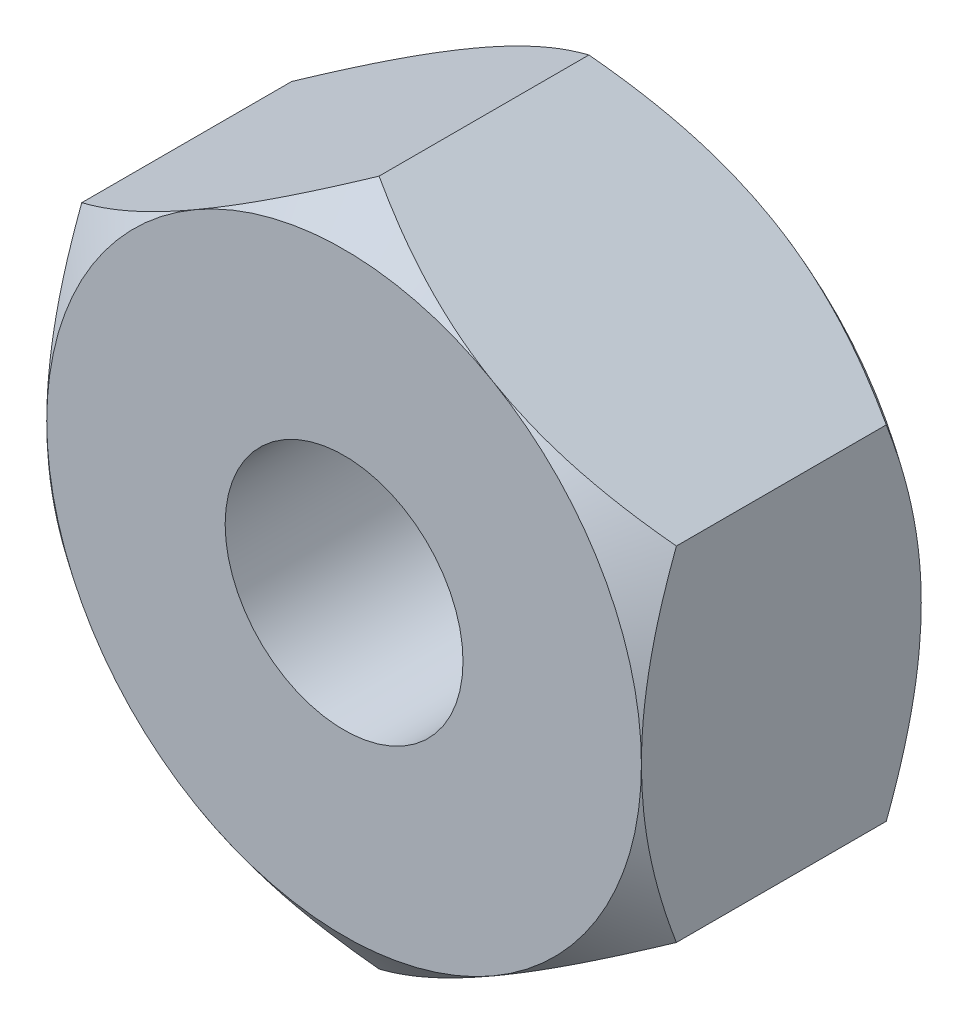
ISO-10303-21;
HEADER;
FILE_DESCRIPTION(('STEP AP214'),'2;1');
FILE_NAME('part.step','',(''),(''),'','','');
FILE_SCHEMA(('AUTOMOTIVE_DESIGN { 1 0 10303 214 1 1 1 1 }'));
ENDSEC;
DATA;
#1=APPLICATION_CONTEXT('core data for automotive mechanical design processes');
#2=APPLICATION_PROTOCOL_DEFINITION('international standard','automotive_design',2000,#1);
#3=PRODUCT_CONTEXT('',#1,'mechanical');
#4=PRODUCT('Part','Part','',(#3));
#5=PRODUCT_RELATED_PRODUCT_CATEGORY('part','',(#4));
#6=PRODUCT_DEFINITION_FORMATION('','',#4);
#7=PRODUCT_DEFINITION_CONTEXT('part definition',#1,'design');
#8=PRODUCT_DEFINITION('design','',#6,#7);
#9=PRODUCT_DEFINITION_SHAPE('','',#8);
#10=(LENGTH_UNIT() NAMED_UNIT(*) SI_UNIT(.MILLI.,.METRE.));
#11=(NAMED_UNIT(*) PLANE_ANGLE_UNIT() SI_UNIT($,.RADIAN.));
#12=(NAMED_UNIT(*) SI_UNIT($,.STERADIAN.) SOLID_ANGLE_UNIT());
#13=UNCERTAINTY_MEASURE_WITH_UNIT(LENGTH_MEASURE(1.E-05),#10,'distance_accuracy_value','');
#14=(GEOMETRIC_REPRESENTATION_CONTEXT(3) GLOBAL_UNCERTAINTY_ASSIGNED_CONTEXT((#13)) GLOBAL_UNIT_ASSIGNED_CONTEXT((#10,
#11,#12)) REPRESENTATION_CONTEXT('',''));
#15=CARTESIAN_POINT('',(0.,0.,0.));
#16=DIRECTION('',(0.,0.,1.));
#17=DIRECTION('',(1.,0.,0.));
#18=AXIS2_PLACEMENT_3D('',#15,#16,#17);
#19=CARTESIAN_POINT('',(0.,-9.81495457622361,8.00000000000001));
#20=DIRECTION('',(-0.499999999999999,0.866025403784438,0.));
#21=DIRECTION('',(-0.866025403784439,-0.5,0.));
#22=AXIS2_PLACEMENT_3D('',#19,#20,#21);
#23=PLANE('',#22);
#24=CARTESIAN_POINT('',(-0.000200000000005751,-9.81507004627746,6.99991218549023));
#25=CARTESIAN_POINT('',(0.154773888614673,-9.72559582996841,7.06794759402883));
#26=CARTESIAN_POINT('',(0.310535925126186,-9.63566657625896,7.13355791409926));
#27=CARTESIAN_POINT('',(0.623762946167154,-9.45482487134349,7.2592836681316));
#28=CARTESIAN_POINT('',(0.781228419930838,-9.36391213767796,7.31939747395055));
#29=CARTESIAN_POINT('',(1.25712979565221,-9.08915035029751,7.4907913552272));
#30=CARTESIAN_POINT('',(1.57819270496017,-8.90378459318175,7.59273041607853));
#31=CARTESIAN_POINT('',(2.06284162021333,-8.62397241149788,7.72204771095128));
#32=CARTESIAN_POINT('',(2.22413291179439,-8.53085084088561,7.76109211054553));
#33=CARTESIAN_POINT('',(2.54804997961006,-8.34383723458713,7.83090911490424));
#34=CARTESIAN_POINT('',(2.71067559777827,-8.24994529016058,7.8616826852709));
#35=CARTESIAN_POINT('',(3.03683362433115,-8.06163786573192,7.91431393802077));
#36=CARTESIAN_POINT('',(3.20036488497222,-7.96722304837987,7.93618106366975));
#37=CARTESIAN_POINT('',(3.52814590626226,-7.77797858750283,7.97056598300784));
#38=CARTESIAN_POINT('',(3.69239556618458,-7.6831490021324,7.98308504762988));
#39=CARTESIAN_POINT('',(4.02359631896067,-7.49193015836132,7.99859692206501));
#40=CARTESIAN_POINT('',(4.190552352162,-7.39553804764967,8.00145043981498));
#41=CARTESIAN_POINT('',(4.52436810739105,-7.20280943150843,7.99717209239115));
#42=CARTESIAN_POINT('',(4.69122782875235,-7.10647292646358,7.99004015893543));
#43=CARTESIAN_POINT('',(5.02449122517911,-6.91406321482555,7.96595737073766));
#44=CARTESIAN_POINT('',(5.19089465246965,-6.81799015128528,7.94900195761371));
#45=CARTESIAN_POINT('',(5.52278685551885,-6.62637209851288,7.90567140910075));
#46=CARTESIAN_POINT('',(5.68827550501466,-6.53082718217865,7.87929500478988));
#47=CARTESIAN_POINT('',(6.18273408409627,-6.24535138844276,7.78688387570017));
#48=CARTESIAN_POINT('',(6.50987787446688,-6.05647483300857,7.7075530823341));
#49=CARTESIAN_POINT('',(7.15744751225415,-5.68260032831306,7.5192603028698));
#50=CARTESIAN_POINT('',(7.47787498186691,-5.49760144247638,7.41030556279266));
#51=CARTESIAN_POINT('',(7.91346962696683,-5.24611075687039,7.24434338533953));
#52=CARTESIAN_POINT('',(8.03162001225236,-5.17789660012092,7.19748863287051));
#53=CARTESIAN_POINT('',(8.26672803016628,-5.0421569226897,7.10084793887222));
#54=CARTESIAN_POINT('',(8.3836877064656,-4.97463022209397,7.05106863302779));
#55=CARTESIAN_POINT('',(8.5002,-4.90736181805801,6.99991218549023));
#56=B_SPLINE_CURVE_WITH_KNOTS('',3,(#24,#25,#26,#27,#28,#29,#30,#31,#32,#33,#34,#35,#36,#37,#38,
#39,#40,#41,#42,#43,#44,#45,#46,#47,#48,#49,#50,#51,#52,#53,#54,#55),.UNSPECIFIED.,.F.,.F.,(4,2,
2,2,2,2,2,2,2,2,2,2,2,2,2,4),(0.,0.57428550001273,1.14874056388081,2.30090758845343,
2.87163475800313,3.44229526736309,4.01234913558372,4.58232548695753,5.16048171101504,
5.73864188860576,6.31707056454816,6.89557717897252,8.05196379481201,9.20806781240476,
9.64079373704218,10.0725731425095),.UNSPECIFIED.);
#57=CARTESIAN_POINT('',(0.,-9.81495457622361,6.9999999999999));
#58=VERTEX_POINT('',#57);
#59=CARTESIAN_POINT('',(4.24999999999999,-7.36121593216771,8.00000000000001));
#60=VERTEX_POINT('',#59);
#61=EDGE_CURVE('E558',#58,#60,#56,.T.);
#62=ORIENTED_EDGE('',*,*,#61,.F.);
#63=DIRECTION('',(0.,0.,-1.));
#64=VECTOR('',#63,1.);
#65=CARTESIAN_POINT('',(0.,-9.81495457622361,8.00000000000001));
#66=LINE('',#65,#64);
#67=CARTESIAN_POINT('',(0.,-9.81495457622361,1.00000000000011));
#68=VERTEX_POINT('',#67);
#69=EDGE_CURVE('E468',#58,#68,#66,.T.);
#70=ORIENTED_EDGE('',*,*,#69,.T.);
#71=CARTESIAN_POINT('',(8.5002,-4.90736181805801,1.00008781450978));
#72=CARTESIAN_POINT('',(8.34522611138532,-4.99683603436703,0.932052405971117));
#73=CARTESIAN_POINT('',(8.1894640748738,-5.08676528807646,0.866442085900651));
#74=CARTESIAN_POINT('',(7.87623705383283,-5.26760699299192,0.740716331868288));
#75=CARTESIAN_POINT('',(7.71877158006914,-5.35851972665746,0.680602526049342));
#76=CARTESIAN_POINT('',(7.24287020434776,-5.63328151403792,0.509208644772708));
#77=CARTESIAN_POINT('',(6.92180729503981,-5.81864727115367,0.407269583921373));
#78=CARTESIAN_POINT('',(6.43715837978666,-6.09845945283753,0.277952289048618));
#79=CARTESIAN_POINT('',(6.2758670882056,-6.1915810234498,0.238907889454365));
#80=CARTESIAN_POINT('',(5.95195002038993,-6.37859462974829,0.169090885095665));
#81=CARTESIAN_POINT('',(5.78932440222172,-6.47248657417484,0.138317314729));
#82=CARTESIAN_POINT('',(5.46316637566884,-6.6607939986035,0.0856860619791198));
#83=CARTESIAN_POINT('',(5.29963511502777,-6.75520881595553,0.0638189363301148));
#84=CARTESIAN_POINT('',(4.97185409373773,-6.9444532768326,0.0294340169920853));
#85=CARTESIAN_POINT('',(4.80760443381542,-7.03928286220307,0.0169149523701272));
#86=CARTESIAN_POINT('',(4.47640368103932,-7.23050170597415,0.00140307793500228));
#87=CARTESIAN_POINT('',(4.30944764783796,-7.32689381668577,-0.00145043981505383));
#88=CARTESIAN_POINT('',(3.97563189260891,-7.519622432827,0.00282790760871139));
#89=CARTESIAN_POINT('',(3.8087721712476,-7.61595893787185,0.00995984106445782));
#90=CARTESIAN_POINT('',(3.47550877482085,-7.80836864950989,0.0340426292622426));
#91=CARTESIAN_POINT('',(3.30910534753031,-7.90444171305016,0.0509980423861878));
#92=CARTESIAN_POINT('',(2.97721314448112,-8.09605976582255,0.094328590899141));
#93=CARTESIAN_POINT('',(2.81172449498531,-8.19160468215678,0.120704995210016));
#94=CARTESIAN_POINT('',(2.3172659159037,-8.47708047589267,0.213116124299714));
#95=CARTESIAN_POINT('',(1.99012212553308,-8.66595703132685,0.29244691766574));
#96=CARTESIAN_POINT('',(1.34255248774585,-9.03983153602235,0.480739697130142));
#97=CARTESIAN_POINT('',(1.02212501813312,-9.22483042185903,0.58969443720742));
#98=CARTESIAN_POINT('',(0.586530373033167,-9.47632110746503,0.755656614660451));
#99=CARTESIAN_POINT('',(0.468379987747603,-9.5445352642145,0.802511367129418));
#100=CARTESIAN_POINT('',(0.233271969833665,-9.68027494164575,0.89915206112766));
#101=CARTESIAN_POINT('',(0.116312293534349,-9.74780164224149,0.948931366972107));
#102=CARTESIAN_POINT('',(-0.000200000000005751,-9.81507004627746,1.00008781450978));
#103=B_SPLINE_CURVE_WITH_KNOTS('',3,(#71,#72,#73,#74,#75,#76,#77,#78,#79,#80,#81,#82,#83,#84,
#85,#86,#87,#88,#89,#90,#91,#92,#93,#94,#95,#96,#97,#98,#99,#100,#101,#102),.UNSPECIFIED.,.F.,
.F.,(4,2,2,2,2,2,2,2,2,2,2,2,2,2,2,4),(0.,0.574285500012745,1.14874056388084,2.30090758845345,
2.87163475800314,3.4422952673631,4.01234913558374,4.58232548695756,5.16048171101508,
5.7386418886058,6.3170705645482,6.89557717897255,8.05196379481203,9.20806781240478,
9.64079373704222,10.0725731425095),.UNSPECIFIED.);
#104=CARTESIAN_POINT('',(4.24999999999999,-7.36121593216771,0.));
#105=VERTEX_POINT('',#104);
#106=EDGE_CURVE('E512',#105,#68,#103,.T.);
#107=ORIENTED_EDGE('',*,*,#106,.F.);
#108=CARTESIAN_POINT('',(8.49999999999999,-4.90747728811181,0.99999999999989));
#109=VERTEX_POINT('',#108);
#110=EDGE_CURVE('E592',#109,#105,#103,.T.);
#111=ORIENTED_EDGE('',*,*,#110,.F.);
#112=DIRECTION('',(0.,0.,-1.));
#113=VECTOR('',#112,1.);
#114=CARTESIAN_POINT('',(8.49999999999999,-4.90747728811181,8.00000000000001));
#115=LINE('',#114,#113);
#116=CARTESIAN_POINT('',(8.49999999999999,-4.90747728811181,6.9999999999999));
#117=VERTEX_POINT('',#116);
#118=EDGE_CURVE('E473',#117,#109,#115,.T.);
#119=ORIENTED_EDGE('',*,*,#118,.F.);
#120=EDGE_CURVE('E554',#60,#117,#56,.T.);
#121=ORIENTED_EDGE('',*,*,#120,.F.);
#122=EDGE_LOOP('',(#62,#70,#107,#111,#119,#121));
#123=FACE_BOUND('',#122,.T.);
#124=ADVANCED_FACE('F348',(#123),#23,.F.);
#125=CARTESIAN_POINT('',(8.49999999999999,-4.90747728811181,8.00000000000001));
#126=DIRECTION('',(-1.,0.,0.));
#127=DIRECTION('',(0.,0.,1.));
#128=AXIS2_PLACEMENT_3D('',#125,#126,#127);
#129=PLANE('',#128);
#130=CARTESIAN_POINT('',(8.49999999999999,-11.4988448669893,3.58964177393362));
#131=CARTESIAN_POINT('',(8.49999999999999,-11.1961340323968,3.77471543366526));
#132=CARTESIAN_POINT('',(8.5,-10.8922997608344,3.95798224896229));
#133=CARTESIAN_POINT('',(8.5,-10.2818698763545,4.31999758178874));
#134=CARTESIAN_POINT('',(8.5,-9.97527370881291,4.49874516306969));
#135=CARTESIAN_POINT('',(8.5,-9.35688206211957,4.85190993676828));
#136=CARTESIAN_POINT('',(8.49999999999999,-9.04506557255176,5.02629046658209));
#137=CARTESIAN_POINT('',(8.49999999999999,-8.41768892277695,5.36815910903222));
#138=CARTESIAN_POINT('',(8.49999999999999,-8.10212898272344,5.53564762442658));
#139=CARTESIAN_POINT('',(8.49999999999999,-7.45193398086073,5.86959951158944));
#140=CARTESIAN_POINT('',(8.49999999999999,-7.11709046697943,6.03565921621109));
#141=CARTESIAN_POINT('',(8.49999999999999,-6.44169262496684,6.35592851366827));
#142=CARTESIAN_POINT('',(8.49999999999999,-6.10113754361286,6.51013652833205));
#143=CARTESIAN_POINT('',(8.49999999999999,-5.41435596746,6.80303232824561));
#144=CARTESIAN_POINT('',(8.49999999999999,-5.06814571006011,6.94175781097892));
#145=CARTESIAN_POINT('',(8.49999999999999,-4.36868728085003,7.19992243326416));
#146=CARTESIAN_POINT('',(8.49999999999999,-4.01544180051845,7.31936879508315));
#147=CARTESIAN_POINT('',(8.49999999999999,-3.29260616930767,7.53667035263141));
#148=CARTESIAN_POINT('',(8.49999999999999,-2.92282795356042,7.63391609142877));
#149=CARTESIAN_POINT('',(8.49999999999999,-2.36304219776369,7.75623288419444));
#150=CARTESIAN_POINT('',(8.49999999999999,-2.1755760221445,7.79308220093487));
#151=CARTESIAN_POINT('',(8.49999999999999,-1.79917612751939,7.85824891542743));
#152=CARTESIAN_POINT('',(8.49999999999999,-1.61024261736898,7.88656750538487));
#153=CARTESIAN_POINT('',(8.49999999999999,-1.23443703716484,7.93368293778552));
#154=CARTESIAN_POINT('',(8.49999999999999,-1.04758423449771,7.95263289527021));
#155=CARTESIAN_POINT('',(8.49999999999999,-0.673167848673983,7.98130707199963));
#156=CARTESIAN_POINT('',(8.49999999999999,-0.485604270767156,7.9910313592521));
#157=CARTESIAN_POINT('',(8.49999999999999,-0.110226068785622,8.00103043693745));
#158=CARTESIAN_POINT('',(8.49999999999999,0.0775885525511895,8.00130532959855));
#159=CARTESIAN_POINT('',(8.49999999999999,0.452990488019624,7.99239953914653));
#160=CARTESIAN_POINT('',(8.49999999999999,0.640577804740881,7.98321896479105));
#161=CARTESIAN_POINT('',(8.49999999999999,1.00024316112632,7.95670657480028));
#162=CARTESIAN_POINT('',(8.49999999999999,1.17237354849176,7.94007746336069));
#163=CARTESIAN_POINT('',(8.49999999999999,1.51574729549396,7.89929562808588));
#164=CARTESIAN_POINT('',(8.49999999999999,1.68699056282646,7.8751421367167));
#165=CARTESIAN_POINT('',(8.49999999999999,2.19894259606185,7.79200612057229));
#166=CARTESIAN_POINT('',(8.49999999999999,2.53795099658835,7.72234202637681));
#167=CARTESIAN_POINT('',(8.49999999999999,3.21645991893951,7.55709142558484));
#168=CARTESIAN_POINT('',(8.49999999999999,3.55584128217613,7.46102620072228));
#169=CARTESIAN_POINT('',(8.49999999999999,4.05988961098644,7.30144686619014));
#170=CARTESIAN_POINT('',(8.49999999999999,4.22706552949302,7.24567462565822));
#171=CARTESIAN_POINT('',(8.49999999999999,4.559792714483,7.12948993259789));
#172=CARTESIAN_POINT('',(8.49999999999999,4.7253440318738,7.0690776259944));
#173=CARTESIAN_POINT('',(8.49999999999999,5.20920160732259,6.8855888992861));
#174=CARTESIAN_POINT('',(8.49999999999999,5.52535249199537,6.75681638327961));
#175=CARTESIAN_POINT('',(8.49999999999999,6.15233262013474,6.48684544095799));
#176=CARTESIAN_POINT('',(8.49999999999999,6.46316058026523,6.34564406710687));
#177=CARTESIAN_POINT('',(8.49999999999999,7.08036655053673,6.05317540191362));
#178=CARTESIAN_POINT('',(8.49999999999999,7.38674028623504,5.90189913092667));
#179=CARTESIAN_POINT('',(8.49999999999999,7.99536190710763,5.59135540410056));
#180=CARTESIAN_POINT('',(8.49999999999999,8.29761010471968,5.432088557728));
#181=CARTESIAN_POINT('',(8.49999999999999,8.89996391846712,5.10632351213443));
#182=CARTESIAN_POINT('',(8.49999999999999,9.20005337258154,4.93979552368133));
#183=CARTESIAN_POINT('',(8.49999999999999,9.79719793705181,4.60138882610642));
#184=CARTESIAN_POINT('',(8.49999999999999,10.0942530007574,4.42951003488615));
#185=CARTESIAN_POINT('',(8.49999999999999,10.6856190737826,4.08142812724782));
#186=CARTESIAN_POINT('',(8.49999999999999,10.9799313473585,3.90522715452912));
#187=CARTESIAN_POINT('',(8.49999999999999,11.5663288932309,3.54915399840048));
#188=CARTESIAN_POINT('',(8.49999999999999,11.858414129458,3.369281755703));
#189=CARTESIAN_POINT('',(8.49999999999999,12.6735948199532,2.86133456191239));
#190=CARTESIAN_POINT('',(8.49999999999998,13.1945494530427,2.52982421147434));
#191=CARTESIAN_POINT('',(8.49999999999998,14.2317398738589,1.85939319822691));
#192=CARTESIAN_POINT('',(8.49999999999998,14.7479750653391,1.52047161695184));
#193=CARTESIAN_POINT('',(8.49999999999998,15.7716273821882,0.840362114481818));
#194=CARTESIAN_POINT('',(8.49999999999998,16.2790812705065,0.499229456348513));
#195=CARTESIAN_POINT('',(8.49999999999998,17.0380119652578,-0.015670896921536));
#196=CARTESIAN_POINT('',(8.49999999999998,17.2905892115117,-0.187820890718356));
#197=CARTESIAN_POINT('',(8.49999999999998,17.7950814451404,-0.533085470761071));
#198=CARTESIAN_POINT('',(8.49999999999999,18.0469964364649,-0.706200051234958));
#199=CARTESIAN_POINT('',(8.49999999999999,18.2986173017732,-0.879741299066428));
#200=B_SPLINE_CURVE_WITH_KNOTS('',3,(#130,#131,#132,#133,#134,#135,#136,#137,#138,#139,#140,
#141,#142,#143,#144,#145,#146,#147,#148,#149,#150,#151,#152,#153,#154,#155,#156,#157,#158,#159,
#160,#161,#162,#163,#164,#165,#166,#167,#168,#169,#170,#171,#172,#173,#174,#175,#176,#177,#178,
#179,#180,#181,#182,#183,#184,#185,#186,#187,#188,#189,#190,#191,#192,#193,#194,#195,#196,#197,
#198,#199),.UNSPECIFIED.,.F.,.F.,(4,2,2,2,2,2,2,2,2,2,2,2,2,2,2,2,2,2,2,2,2,2,2,2,2,2,2,2,2,2,2,
2,2,2,4),(0.,1.06443043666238,2.12907961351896,3.2008024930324,4.27246265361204,5.393556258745,
6.51479889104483,7.6332490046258,8.75127915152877,9.89705804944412,10.4700551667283,
11.0429721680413,11.6061877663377,12.1693992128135,12.7326045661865,13.2958034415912,
13.8144239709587,14.3330974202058,15.3702121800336,16.4275382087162,16.9561825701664,
17.4848103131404,18.5085534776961,19.5325400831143,20.5574518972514,21.5822856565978,
22.6118150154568,23.6413601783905,24.670404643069,25.6994657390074,27.5518386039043,
29.4044423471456,31.2387862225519,32.1557785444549,33.0727653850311),.UNSPECIFIED.);
#201=CARTESIAN_POINT('',(8.49999999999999,0.,8.00000000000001));
#202=VERTEX_POINT('',#201);
#203=EDGE_CURVE('E548',#117,#202,#200,.T.);
#204=ORIENTED_EDGE('',*,*,#203,.F.);
#205=ORIENTED_EDGE('',*,*,#118,.T.);
#206=CARTESIAN_POINT('',(8.49999999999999,-11.4988448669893,4.41035822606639));
#207=CARTESIAN_POINT('',(8.49999999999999,-11.1961340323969,4.2252845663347));
#208=CARTESIAN_POINT('',(8.5,-10.8922997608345,4.04201775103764));
#209=CARTESIAN_POINT('',(8.5,-10.2818698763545,3.68000241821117));
#210=CARTESIAN_POINT('',(8.5,-9.97527370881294,3.50125483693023));
#211=CARTESIAN_POINT('',(8.5,-9.3568820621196,3.14809006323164));
#212=CARTESIAN_POINT('',(8.49999999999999,-9.04506557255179,2.97370953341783));
#213=CARTESIAN_POINT('',(8.49999999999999,-8.41768892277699,2.6318408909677));
#214=CARTESIAN_POINT('',(8.49999999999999,-8.10212898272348,2.46435237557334));
#215=CARTESIAN_POINT('',(8.49999999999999,-7.45193398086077,2.13040048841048));
#216=CARTESIAN_POINT('',(8.49999999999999,-7.11709046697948,1.96434078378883));
#217=CARTESIAN_POINT('',(8.49999999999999,-6.44169262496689,1.64407148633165));
#218=CARTESIAN_POINT('',(8.49999999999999,-6.10113754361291,1.48986347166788));
#219=CARTESIAN_POINT('',(8.49999999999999,-5.41435596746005,1.1969676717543));
#220=CARTESIAN_POINT('',(8.49999999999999,-5.06814571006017,1.05824218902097));
#221=CARTESIAN_POINT('',(8.49999999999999,-4.36868728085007,0.80007756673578));
#222=CARTESIAN_POINT('',(8.49999999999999,-4.01544180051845,0.680631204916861));
#223=CARTESIAN_POINT('',(8.49999999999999,-3.29260616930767,0.463329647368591));
#224=CARTESIAN_POINT('',(8.49999999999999,-2.92282795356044,0.366083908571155));
#225=CARTESIAN_POINT('',(8.49999999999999,-2.36304219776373,0.243767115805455));
#226=CARTESIAN_POINT('',(8.49999999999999,-2.17557602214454,0.206917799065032));
#227=CARTESIAN_POINT('',(8.49999999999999,-1.79917612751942,0.141751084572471));
#228=CARTESIAN_POINT('',(8.49999999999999,-1.61024261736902,0.113432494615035));
#229=CARTESIAN_POINT('',(8.49999999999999,-1.23443703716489,0.0663170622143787));
#230=CARTESIAN_POINT('',(8.49999999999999,-1.04758423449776,0.0473671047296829));
#231=CARTESIAN_POINT('',(8.49999999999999,-0.673167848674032,0.0186929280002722));
#232=CARTESIAN_POINT('',(8.49999999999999,-0.485604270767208,0.00896864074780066));
#233=CARTESIAN_POINT('',(8.49999999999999,-0.110226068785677,-0.00103043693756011));
#234=CARTESIAN_POINT('',(8.49999999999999,0.0775885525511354,-0.00130532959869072));
#235=CARTESIAN_POINT('',(8.49999999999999,0.452990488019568,0.00760046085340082));
#236=CARTESIAN_POINT('',(8.49999999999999,0.640577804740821,0.0167810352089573));
#237=CARTESIAN_POINT('',(8.49999999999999,1.00024316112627,0.0432934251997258));
#238=CARTESIAN_POINT('',(8.49999999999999,1.17237354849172,0.0599225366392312));
#239=CARTESIAN_POINT('',(8.49999999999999,1.51574729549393,0.100704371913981));
#240=CARTESIAN_POINT('',(8.49999999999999,1.68699056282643,0.124857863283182));
#241=CARTESIAN_POINT('',(8.49999999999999,2.19894259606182,0.207993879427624));
#242=CARTESIAN_POINT('',(8.49999999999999,2.53795099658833,0.277657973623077));
#243=CARTESIAN_POINT('',(8.49999999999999,3.21645991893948,0.442908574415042));
#244=CARTESIAN_POINT('',(8.49999999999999,3.5558412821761,0.538973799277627));
#245=CARTESIAN_POINT('',(8.49999999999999,4.05988961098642,0.698553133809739));
#246=CARTESIAN_POINT('',(8.49999999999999,4.227065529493,0.75432537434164));
#247=CARTESIAN_POINT('',(8.49999999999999,4.55979271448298,0.870510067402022));
#248=CARTESIAN_POINT('',(8.49999999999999,4.72534403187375,0.930922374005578));
#249=CARTESIAN_POINT('',(8.49999999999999,5.20920160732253,1.11441110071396));
#250=CARTESIAN_POINT('',(8.49999999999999,5.52535249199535,1.24318361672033));
#251=CARTESIAN_POINT('',(8.49999999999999,6.15233262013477,1.51315455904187));
#252=CARTESIAN_POINT('',(8.49999999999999,6.46316058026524,1.65435593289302));
#253=CARTESIAN_POINT('',(8.49999999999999,7.08036655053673,1.9468245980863));
#254=CARTESIAN_POINT('',(8.49999999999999,7.38674028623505,2.09810086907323));
#255=CARTESIAN_POINT('',(8.49999999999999,7.99536190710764,2.40864459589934));
#256=CARTESIAN_POINT('',(8.49999999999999,8.29761010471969,2.5679114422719));
#257=CARTESIAN_POINT('',(8.49999999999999,8.89996391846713,2.89367648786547));
#258=CARTESIAN_POINT('',(8.49999999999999,9.20005337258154,3.06020447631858));
#259=CARTESIAN_POINT('',(8.49999999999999,9.79719793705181,3.39861117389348));
#260=CARTESIAN_POINT('',(8.49999999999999,10.0942530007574,3.57048996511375));
#261=CARTESIAN_POINT('',(8.49999999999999,10.6856190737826,3.91857187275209));
#262=CARTESIAN_POINT('',(8.49999999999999,10.9799313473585,4.09477284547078));
#263=CARTESIAN_POINT('',(8.49999999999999,11.5663288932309,4.45084600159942));
#264=CARTESIAN_POINT('',(8.49999999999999,11.858414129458,4.6307182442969));
#265=CARTESIAN_POINT('',(8.49999999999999,12.6735948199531,5.13866543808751));
#266=CARTESIAN_POINT('',(8.49999999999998,13.1945494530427,5.47017578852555));
#267=CARTESIAN_POINT('',(8.49999999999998,14.2317398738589,6.14060680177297));
#268=CARTESIAN_POINT('',(8.49999999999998,14.7479750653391,6.47952838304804));
#269=CARTESIAN_POINT('',(8.49999999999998,15.7716273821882,7.15963788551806));
#270=CARTESIAN_POINT('',(8.49999999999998,16.2790812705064,7.50077054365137));
#271=CARTESIAN_POINT('',(8.49999999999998,17.0380119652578,8.01567089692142));
#272=CARTESIAN_POINT('',(8.49999999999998,17.2905892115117,8.18782089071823));
#273=CARTESIAN_POINT('',(8.49999999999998,17.7950814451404,8.53308547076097));
#274=CARTESIAN_POINT('',(8.49999999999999,18.0469964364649,8.70620005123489));
#275=CARTESIAN_POINT('',(8.49999999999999,18.2986173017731,8.87974129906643));
#276=B_SPLINE_CURVE_WITH_KNOTS('',3,(#206,#207,#208,#209,#210,#211,#212,#213,#214,#215,#216,
#217,#218,#219,#220,#221,#222,#223,#224,#225,#226,#227,#228,#229,#230,#231,#232,#233,#234,#235,
#236,#237,#238,#239,#240,#241,#242,#243,#244,#245,#246,#247,#248,#249,#250,#251,#252,#253,#254,
#255,#256,#257,#258,#259,#260,#261,#262,#263,#264,#265,#266,#267,#268,#269,#270,#271,#272,#273,
#274,#275),.UNSPECIFIED.,.F.,.F.,(4,2,2,2,2,2,2,2,2,2,2,2,2,2,2,2,2,2,2,2,2,2,2,2,2,2,2,2,2,2,2,
2,2,2,4),(0.,1.0644304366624,2.12907961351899,3.20080249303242,4.27246265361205,
5.39355625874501,6.51479889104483,7.6332490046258,8.75127915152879,9.89705804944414,
10.4700551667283,11.0429721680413,11.6061877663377,12.1693992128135,12.7326045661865,
13.2958034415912,13.8144239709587,14.3330974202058,15.3702121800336,16.4275382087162,
16.9561825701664,17.4848103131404,18.5085534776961,19.5325400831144,20.5574518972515,
21.5822856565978,22.6118150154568,23.6413601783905,24.670404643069,25.6994657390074,
27.5518386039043,29.4044423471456,31.2387862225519,32.155778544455,33.0727653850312),.UNSPECIFIED.);
#277=CARTESIAN_POINT('',(8.49999999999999,0.,0.));
#278=VERTEX_POINT('',#277);
#279=EDGE_CURVE('E522',#278,#109,#276,.F.);
#280=ORIENTED_EDGE('',*,*,#279,.F.);
#281=CARTESIAN_POINT('',(8.49999999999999,4.90747728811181,0.99999999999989));
#282=VERTEX_POINT('',#281);
#283=EDGE_CURVE('E527',#282,#278,#276,.F.);
#284=ORIENTED_EDGE('',*,*,#283,.F.);
#285=DIRECTION('',(0.,0.,-1.));
#286=VECTOR('',#285,1.);
#287=CARTESIAN_POINT('',(8.49999999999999,4.90747728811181,8.00000000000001));
#288=LINE('',#287,#286);
#289=CARTESIAN_POINT('',(8.49999999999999,4.90747728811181,6.9999999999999));
#290=VERTEX_POINT('',#289);
#291=EDGE_CURVE('E466',#290,#282,#288,.T.);
#292=ORIENTED_EDGE('',*,*,#291,.F.);
#293=EDGE_CURVE('E542',#202,#290,#200,.T.);
#294=ORIENTED_EDGE('',*,*,#293,.F.);
#295=EDGE_LOOP('',(#204,#205,#280,#284,#292,#294));
#296=FACE_BOUND('',#295,.T.);
#297=ADVANCED_FACE('F534',(#296),#129,.F.);
#298=CARTESIAN_POINT('',(8.49999999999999,4.90747728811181,8.00000000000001));
#299=DIRECTION('',(-0.500000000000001,-0.866025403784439,0.));
#300=DIRECTION('',(0.866025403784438,-0.5,0.));
#301=AXIS2_PLACEMENT_3D('',#298,#299,#300);
#302=PLANE('',#301);
#303=CARTESIAN_POINT('',(8.5002,4.90736181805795,6.99991218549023));
#304=CARTESIAN_POINT('',(8.34522611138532,4.99683603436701,7.06794759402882));
#305=CARTESIAN_POINT('',(8.1894640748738,5.08676528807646,7.13355791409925));
#306=CARTESIAN_POINT('',(7.87623705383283,5.26760699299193,7.25928366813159));
#307=CARTESIAN_POINT('',(7.71877158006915,5.35851972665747,7.31939747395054));
#308=CARTESIAN_POINT('',(7.24287020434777,5.63328151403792,7.49079135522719));
#309=CARTESIAN_POINT('',(6.92180729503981,5.81864727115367,7.59273041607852));
#310=CARTESIAN_POINT('',(6.43715837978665,6.09845945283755,7.72204771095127));
#311=CARTESIAN_POINT('',(6.27586708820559,6.19158102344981,7.76109211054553));
#312=CARTESIAN_POINT('',(5.95195002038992,6.37859462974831,7.83090911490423));
#313=CARTESIAN_POINT('',(5.78932440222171,6.47248657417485,7.8616826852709));
#314=CARTESIAN_POINT('',(5.46316637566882,6.66079399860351,7.91431393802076));
#315=CARTESIAN_POINT('',(5.29963511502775,6.75520881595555,7.93618106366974));
#316=CARTESIAN_POINT('',(4.97185409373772,6.94445327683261,7.97056598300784));
#317=CARTESIAN_POINT('',(4.80760443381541,7.03928286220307,7.98308504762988));
#318=CARTESIAN_POINT('',(4.47640368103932,7.23050170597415,7.998596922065));
#319=CARTESIAN_POINT('',(4.30944764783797,7.32689381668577,8.00145043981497));
#320=CARTESIAN_POINT('',(3.97563189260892,7.519622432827,7.99717209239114));
#321=CARTESIAN_POINT('',(3.80877217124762,7.61595893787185,7.99004015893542));
#322=CARTESIAN_POINT('',(3.47550877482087,7.80836864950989,7.96595737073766));
#323=CARTESIAN_POINT('',(3.30910534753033,7.90444171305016,7.9490019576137));
#324=CARTESIAN_POINT('',(2.97721314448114,8.09605976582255,7.90567140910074));
#325=CARTESIAN_POINT('',(2.81172449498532,8.19160468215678,7.87929500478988));
#326=CARTESIAN_POINT('',(2.31726591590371,8.47708047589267,7.78688387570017));
#327=CARTESIAN_POINT('',(1.99012212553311,8.66595703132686,7.7075530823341));
#328=CARTESIAN_POINT('',(1.34255248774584,9.03983153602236,7.5192603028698));
#329=CARTESIAN_POINT('',(1.02212501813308,9.22483042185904,7.41030556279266));
#330=CARTESIAN_POINT('',(0.586530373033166,9.47632110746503,7.24434338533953));
#331=CARTESIAN_POINT('',(0.468379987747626,9.5445352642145,7.1974886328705));
#332=CARTESIAN_POINT('',(0.23327196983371,9.68027494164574,7.10084793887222));
#333=CARTESIAN_POINT('',(0.116312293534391,9.74780164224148,7.05106863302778));
#334=CARTESIAN_POINT('',(-0.000200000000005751,9.81507004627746,6.99991218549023));
#335=B_SPLINE_CURVE_WITH_KNOTS('',3,(#303,#304,#305,#306,#307,#308,#309,#310,#311,#312,#313,
#314,#315,#316,#317,#318,#319,#320,#321,#322,#323,#324,#325,#326,#327,#328,#329,#330,#331,#332,
#333,#334),.UNSPECIFIED.,.F.,.F.,(4,2,2,2,2,2,2,2,2,2,2,2,2,2,2,4),(0.,0.574285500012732,
1.14874056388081,2.30090758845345,2.87163475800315,3.44229526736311,4.01234913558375,
4.58232548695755,5.16048171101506,5.73864188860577,6.31707056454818,6.89557717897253,
8.05196379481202,9.20806781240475,9.64079373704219,10.0725731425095),.UNSPECIFIED.);
#336=CARTESIAN_POINT('',(4.25,7.36121593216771,8.00000000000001));
#337=VERTEX_POINT('',#336);
#338=EDGE_CURVE('E549',#290,#337,#335,.T.);
#339=ORIENTED_EDGE('',*,*,#338,.F.);
#340=ORIENTED_EDGE('',*,*,#291,.T.);
#341=CARTESIAN_POINT('',(-0.000199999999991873,9.81507004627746,1.00008781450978));
#342=CARTESIAN_POINT('',(0.154773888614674,9.72559582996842,0.93205240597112));
#343=CARTESIAN_POINT('',(0.310535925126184,9.63566657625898,0.866442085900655));
#344=CARTESIAN_POINT('',(0.623762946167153,9.45482487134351,0.740716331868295));
#345=CARTESIAN_POINT('',(0.781228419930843,9.36391213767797,0.680602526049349));
#346=CARTESIAN_POINT('',(1.25712979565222,9.08915035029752,0.509208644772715));
#347=CARTESIAN_POINT('',(1.57819270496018,8.90378459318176,0.40726958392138));
#348=CARTESIAN_POINT('',(2.06284162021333,8.6239724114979,0.277952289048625));
#349=CARTESIAN_POINT('',(2.22413291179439,8.53085084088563,0.238907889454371));
#350=CARTESIAN_POINT('',(2.54804997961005,8.34383723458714,0.169090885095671));
#351=CARTESIAN_POINT('',(2.71067559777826,8.2499452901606,0.138317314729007));
#352=CARTESIAN_POINT('',(3.03683362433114,8.06163786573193,0.0856860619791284));
#353=CARTESIAN_POINT('',(3.20036488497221,7.96722304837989,0.0638189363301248));
#354=CARTESIAN_POINT('',(3.52814590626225,7.77797858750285,0.029434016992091));
#355=CARTESIAN_POINT('',(3.69239556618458,7.68314900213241,0.0169149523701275));
#356=CARTESIAN_POINT('',(4.02359631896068,7.49193015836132,0.00140307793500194));
#357=CARTESIAN_POINT('',(4.19055235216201,7.39553804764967,-0.00145043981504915));
#358=CARTESIAN_POINT('',(4.52436810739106,7.20280943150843,0.00282790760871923));
#359=CARTESIAN_POINT('',(4.69122782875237,7.10647292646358,0.00995984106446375));
#360=CARTESIAN_POINT('',(5.02449122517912,6.91406321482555,0.0340426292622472));
#361=CARTESIAN_POINT('',(5.19089465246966,6.81799015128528,0.0509980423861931));
#362=CARTESIAN_POINT('',(5.52278685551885,6.62637209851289,0.0943285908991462));
#363=CARTESIAN_POINT('',(5.68827550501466,6.53082718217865,0.120704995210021));
#364=CARTESIAN_POINT('',(6.18273408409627,6.24535138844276,0.213116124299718));
#365=CARTESIAN_POINT('',(6.50987787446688,6.05647483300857,0.292446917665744));
#366=CARTESIAN_POINT('',(7.15744751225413,5.6826003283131,0.480739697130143));
#367=CARTESIAN_POINT('',(7.47787498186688,5.49760144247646,0.589694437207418));
#368=CARTESIAN_POINT('',(7.91346962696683,5.24611075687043,0.755656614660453));
#369=CARTESIAN_POINT('',(8.03162001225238,5.17789660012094,0.802511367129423));
#370=CARTESIAN_POINT('',(8.26672803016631,5.04215692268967,0.899152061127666));
#371=CARTESIAN_POINT('',(8.38368770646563,4.97463022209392,0.948931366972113));
#372=CARTESIAN_POINT('',(8.5002,4.90736181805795,1.00008781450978));
#373=B_SPLINE_CURVE_WITH_KNOTS('',3,(#341,#342,#343,#344,#345,#346,#347,#348,#349,#350,#351,
#352,#353,#354,#355,#356,#357,#358,#359,#360,#361,#362,#363,#364,#365,#366,#367,#368,#369,#370,
#371,#372),.UNSPECIFIED.,.F.,.F.,(4,2,2,2,2,2,2,2,2,2,2,2,2,2,2,4),(0.,0.574285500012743,
1.14874056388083,2.30090758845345,2.87163475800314,3.4422952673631,4.01234913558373,
4.58232548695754,5.16048171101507,5.73864188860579,6.31707056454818,6.89557717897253,
8.05196379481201,9.20806781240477,9.64079373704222,10.0725731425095),.UNSPECIFIED.);
#374=CARTESIAN_POINT('',(4.25,7.36121593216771,0.));
#375=VERTEX_POINT('',#374);
#376=EDGE_CURVE('E528',#375,#282,#373,.T.);
#377=ORIENTED_EDGE('',*,*,#376,.F.);
#378=CARTESIAN_POINT('',(0.,9.81495457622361,0.99999999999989));
#379=VERTEX_POINT('',#378);
#380=EDGE_CURVE('E609',#379,#375,#373,.T.);
#381=ORIENTED_EDGE('',*,*,#380,.F.);
#382=DIRECTION('',(0.,0.,-1.));
#383=VECTOR('',#382,1.);
#384=CARTESIAN_POINT('',(0.,9.81495457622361,8.00000000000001));
#385=LINE('',#384,#383);
#386=CARTESIAN_POINT('',(0.,9.81495457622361,6.9999999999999));
#387=VERTEX_POINT('',#386);
#388=EDGE_CURVE('E463',#387,#379,#385,.T.);
#389=ORIENTED_EDGE('',*,*,#388,.F.);
#390=EDGE_CURVE('E550',#337,#387,#335,.T.);
#391=ORIENTED_EDGE('',*,*,#390,.F.);
#392=EDGE_LOOP('',(#339,#340,#377,#381,#389,#391));
#393=FACE_BOUND('',#392,.T.);
#394=ADVANCED_FACE('F537',(#393),#302,.F.);
#395=CARTESIAN_POINT('',(0.,9.81495457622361,8.00000000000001));
#396=DIRECTION('',(0.499999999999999,-0.866025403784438,0.));
#397=DIRECTION('',(0.866025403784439,0.500000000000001,0.));
#398=AXIS2_PLACEMENT_3D('',#395,#396,#397);
#399=PLANE('',#398);
#400=CARTESIAN_POINT('',(0.000200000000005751,9.81507004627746,6.99991218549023));
#401=CARTESIAN_POINT('',(-0.154773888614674,9.72559582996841,7.06794759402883));
#402=CARTESIAN_POINT('',(-0.310535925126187,9.63566657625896,7.13355791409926));
#403=CARTESIAN_POINT('',(-0.623762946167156,9.45482487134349,7.2592836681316));
#404=CARTESIAN_POINT('',(-0.78122841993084,9.36391213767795,7.31939747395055));
#405=CARTESIAN_POINT('',(-1.25712979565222,9.08915035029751,7.4907913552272));
#406=CARTESIAN_POINT('',(-1.57819270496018,8.90378459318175,7.59273041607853));
#407=CARTESIAN_POINT('',(-2.06284162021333,8.62397241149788,7.72204771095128));
#408=CARTESIAN_POINT('',(-2.22413291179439,8.53085084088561,7.76109211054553));
#409=CARTESIAN_POINT('',(-2.54804997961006,8.34383723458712,7.83090911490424));
#410=CARTESIAN_POINT('',(-2.71067559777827,8.24994529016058,7.86168268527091));
#411=CARTESIAN_POINT('',(-3.03683362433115,8.06163786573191,7.91431393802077));
#412=CARTESIAN_POINT('',(-3.20036488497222,7.96722304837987,7.93618106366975));
#413=CARTESIAN_POINT('',(-3.52814590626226,7.77797858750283,7.97056598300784));
#414=CARTESIAN_POINT('',(-3.69239556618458,7.6831490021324,7.98308504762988));
#415=CARTESIAN_POINT('',(-4.02359631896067,7.49193015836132,7.998596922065));
#416=CARTESIAN_POINT('',(-4.190552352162,7.39553804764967,8.00145043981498));
#417=CARTESIAN_POINT('',(-4.52436810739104,7.20280943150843,7.99717209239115));
#418=CARTESIAN_POINT('',(-4.69122782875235,7.10647292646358,7.99004015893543));
#419=CARTESIAN_POINT('',(-5.0244912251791,6.91406321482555,7.96595737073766));
#420=CARTESIAN_POINT('',(-5.19089465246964,6.81799015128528,7.94900195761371));
#421=CARTESIAN_POINT('',(-5.52278685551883,6.62637209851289,7.90567140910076));
#422=CARTESIAN_POINT('',(-5.68827550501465,6.53082718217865,7.87929500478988));
#423=CARTESIAN_POINT('',(-6.18273408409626,6.24535138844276,7.78688387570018));
#424=CARTESIAN_POINT('',(-6.50987787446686,6.05647483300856,7.70755308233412));
#425=CARTESIAN_POINT('',(-7.15744751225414,5.68260032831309,7.5192603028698));
#426=CARTESIAN_POINT('',(-7.47787498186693,5.49760144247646,7.41030556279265));
#427=CARTESIAN_POINT('',(-7.91346962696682,5.24611075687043,7.24434338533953));
#428=CARTESIAN_POINT('',(-8.03162001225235,5.17789660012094,7.19748863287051));
#429=CARTESIAN_POINT('',(-8.26672803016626,5.04215692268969,7.10084793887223));
#430=CARTESIAN_POINT('',(-8.38368770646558,4.97463022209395,7.0510686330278));
#431=CARTESIAN_POINT('',(-8.5002,4.90736181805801,6.99991218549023));
#432=B_SPLINE_CURVE_WITH_KNOTS('',3,(#400,#401,#402,#403,#404,#405,#406,#407,#408,#409,#410,
#411,#412,#413,#414,#415,#416,#417,#418,#419,#420,#421,#422,#423,#424,#425,#426,#427,#428,#429,
#430,#431),.UNSPECIFIED.,.F.,.F.,(4,2,2,2,2,2,2,2,2,2,2,2,2,2,2,4),(0.,0.574285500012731,
1.14874056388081,2.30090758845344,2.87163475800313,3.44229526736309,4.01234913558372,
4.58232548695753,5.16048171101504,5.73864188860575,6.31707056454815,6.89557717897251,
8.05196379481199,9.20806781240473,9.64079373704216,10.0725731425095),.UNSPECIFIED.);
#433=CARTESIAN_POINT('',(-4.25,7.36121593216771,8.00000000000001));
#434=VERTEX_POINT('',#433);
#435=EDGE_CURVE('E447',#387,#434,#432,.T.);
#436=ORIENTED_EDGE('',*,*,#435,.F.);
#437=ORIENTED_EDGE('',*,*,#388,.T.);
#438=CARTESIAN_POINT('',(-8.5002,4.90736181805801,1.00008781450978));
#439=CARTESIAN_POINT('',(-8.34522611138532,4.99683603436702,0.932052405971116));
#440=CARTESIAN_POINT('',(-8.1894640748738,5.08676528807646,0.86644208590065));
#441=CARTESIAN_POINT('',(-7.87623705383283,5.26760699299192,0.740716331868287));
#442=CARTESIAN_POINT('',(-7.71877158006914,5.35851972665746,0.680602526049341));
#443=CARTESIAN_POINT('',(-7.24287020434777,5.63328151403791,0.509208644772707));
#444=CARTESIAN_POINT('',(-6.92180729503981,5.81864727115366,0.407269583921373));
#445=CARTESIAN_POINT('',(-6.43715837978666,6.09845945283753,0.277952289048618));
#446=CARTESIAN_POINT('',(-6.2758670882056,6.1915810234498,0.238907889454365));
#447=CARTESIAN_POINT('',(-5.95195002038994,6.37859462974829,0.169090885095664));
#448=CARTESIAN_POINT('',(-5.78932440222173,6.47248657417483,0.138317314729));
#449=CARTESIAN_POINT('',(-5.46316637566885,6.66079399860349,0.0856860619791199));
#450=CARTESIAN_POINT('',(-5.29963511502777,6.75520881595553,0.0638189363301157));
#451=CARTESIAN_POINT('',(-4.97185409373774,6.94445327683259,0.0294340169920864));
#452=CARTESIAN_POINT('',(-4.80760443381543,7.03928286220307,0.0169149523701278));
#453=CARTESIAN_POINT('',(-4.47640368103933,7.23050170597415,0.00140307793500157));
#454=CARTESIAN_POINT('',(-4.30944764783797,7.32689381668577,-0.00145043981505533));
#455=CARTESIAN_POINT('',(-3.97563189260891,7.51962243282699,0.00282790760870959));
#456=CARTESIAN_POINT('',(-3.80877217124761,7.61595893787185,0.0099598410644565));
#457=CARTESIAN_POINT('',(-3.47550877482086,7.80836864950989,0.0340426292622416));
#458=CARTESIAN_POINT('',(-3.30910534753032,7.90444171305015,0.0509980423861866));
#459=CARTESIAN_POINT('',(-2.97721314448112,8.09605976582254,0.0943285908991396));
#460=CARTESIAN_POINT('',(-2.81172449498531,8.19160468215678,0.120704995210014));
#461=CARTESIAN_POINT('',(-2.3172659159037,8.47708047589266,0.213116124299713));
#462=CARTESIAN_POINT('',(-1.99012212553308,8.66595703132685,0.292446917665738));
#463=CARTESIAN_POINT('',(-1.34255248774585,9.03983153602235,0.480739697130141));
#464=CARTESIAN_POINT('',(-1.02212501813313,9.22483042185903,0.589694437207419));
#465=CARTESIAN_POINT('',(-0.586530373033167,9.47632110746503,0.755656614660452));
#466=CARTESIAN_POINT('',(-0.468379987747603,9.5445352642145,0.802511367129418));
#467=CARTESIAN_POINT('',(-0.233271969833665,9.68027494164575,0.89915206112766));
#468=CARTESIAN_POINT('',(-0.116312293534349,9.74780164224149,0.948931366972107));
#469=CARTESIAN_POINT('',(0.000200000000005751,9.81507004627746,1.00008781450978));
#470=B_SPLINE_CURVE_WITH_KNOTS('',3,(#438,#439,#440,#441,#442,#443,#444,#445,#446,#447,#448,
#449,#450,#451,#452,#453,#454,#455,#456,#457,#458,#459,#460,#461,#462,#463,#464,#465,#466,#467,
#468,#469),.UNSPECIFIED.,.F.,.F.,(4,2,2,2,2,2,2,2,2,2,2,2,2,2,2,4),(0.,0.574285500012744,
1.14874056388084,2.30090758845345,2.87163475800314,3.4422952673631,4.01234913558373,
4.58232548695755,5.16048171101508,5.7386418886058,6.31707056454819,6.89557717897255,
8.05196379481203,9.20806781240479,9.64079373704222,10.0725731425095),.UNSPECIFIED.);
#471=CARTESIAN_POINT('',(-4.25,7.36121593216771,0.));
#472=VERTEX_POINT('',#471);
#473=EDGE_CURVE('E606',#472,#379,#470,.T.);
#474=ORIENTED_EDGE('',*,*,#473,.F.);
#475=CARTESIAN_POINT('',(-8.49999999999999,4.90747728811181,0.99999999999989));
#476=VERTEX_POINT('',#475);
#477=EDGE_CURVE('E462',#476,#472,#470,.T.);
#478=ORIENTED_EDGE('',*,*,#477,.F.);
#479=DIRECTION('',(0.,0.,-1.));
#480=VECTOR('',#479,1.);
#481=CARTESIAN_POINT('',(-8.49999999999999,4.90747728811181,8.00000000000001));
#482=LINE('',#481,#480);
#483=CARTESIAN_POINT('',(-8.49999999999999,4.90747728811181,6.9999999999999));
#484=VERTEX_POINT('',#483);
#485=EDGE_CURVE('E453',#484,#476,#482,.T.);
#486=ORIENTED_EDGE('',*,*,#485,.F.);
#487=EDGE_CURVE('E438',#434,#484,#432,.T.);
#488=ORIENTED_EDGE('',*,*,#487,.F.);
#489=EDGE_LOOP('',(#436,#437,#474,#478,#486,#488));
#490=FACE_BOUND('',#489,.T.);
#491=ADVANCED_FACE('F459',(#490),#399,.F.);
#492=CARTESIAN_POINT('',(-8.49999999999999,4.90747728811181,8.00000000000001));
#493=DIRECTION('',(1.,0.,0.));
#494=DIRECTION('',(0.,1.,0.));
#495=AXIS2_PLACEMENT_3D('',#492,#493,#494);
#496=PLANE('',#495);
#497=CARTESIAN_POINT('',(-8.49999999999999,-11.4988448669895,3.58964177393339));
#498=CARTESIAN_POINT('',(-8.49999999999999,-11.1961340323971,3.77471543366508));
#499=CARTESIAN_POINT('',(-8.49999999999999,-10.8922997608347,3.95798224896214));
#500=CARTESIAN_POINT('',(-8.49999999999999,-10.2818698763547,4.31999758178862));
#501=CARTESIAN_POINT('',(-8.49999999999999,-9.97527370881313,4.49874516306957));
#502=CARTESIAN_POINT('',(-8.49999999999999,-9.35688206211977,4.85190993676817));
#503=CARTESIAN_POINT('',(-8.49999999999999,-9.04506557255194,5.02629046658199));
#504=CARTESIAN_POINT('',(-8.49999999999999,-8.41768892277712,5.36815910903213));
#505=CARTESIAN_POINT('',(-8.49999999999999,-8.1021289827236,5.5356476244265));
#506=CARTESIAN_POINT('',(-8.49999999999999,-7.45193398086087,5.86959951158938));
#507=CARTESIAN_POINT('',(-8.49999999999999,-7.11709046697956,6.03565921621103));
#508=CARTESIAN_POINT('',(-8.49999999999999,-6.44169262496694,6.35592851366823));
#509=CARTESIAN_POINT('',(-8.49999999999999,-6.10113754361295,6.51013652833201));
#510=CARTESIAN_POINT('',(-8.49999999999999,-5.41435596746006,6.80303232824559));
#511=CARTESIAN_POINT('',(-8.49999999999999,-5.06814571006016,6.9417578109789));
#512=CARTESIAN_POINT('',(-8.49999999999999,-4.36868728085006,7.19992243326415));
#513=CARTESIAN_POINT('',(-8.49999999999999,-4.01544180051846,7.31936879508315));
#514=CARTESIAN_POINT('',(-8.49999999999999,-3.29260616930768,7.53667035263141));
#515=CARTESIAN_POINT('',(-8.49999999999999,-2.92282795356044,7.63391609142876));
#516=CARTESIAN_POINT('',(-8.49999999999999,-2.36304219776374,7.75623288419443));
#517=CARTESIAN_POINT('',(-8.49999999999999,-2.17557602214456,7.79308220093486));
#518=CARTESIAN_POINT('',(-8.49999999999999,-1.79917612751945,7.85824891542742));
#519=CARTESIAN_POINT('',(-8.49999999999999,-1.61024261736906,7.88656750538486));
#520=CARTESIAN_POINT('',(-8.49999999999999,-1.23443703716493,7.93368293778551));
#521=CARTESIAN_POINT('',(-8.49999999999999,-1.04758423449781,7.95263289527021));
#522=CARTESIAN_POINT('',(-8.49999999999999,-0.673167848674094,7.98130707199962));
#523=CARTESIAN_POINT('',(-8.49999999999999,-0.485604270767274,7.9910313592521));
#524=CARTESIAN_POINT('',(-8.49999999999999,-0.110226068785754,8.00103043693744));
#525=CARTESIAN_POINT('',(-8.49999999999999,0.0775885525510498,8.00130532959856));
#526=CARTESIAN_POINT('',(-8.49999999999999,0.452990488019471,7.99239953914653));
#527=CARTESIAN_POINT('',(-8.49999999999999,0.64057780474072,7.98321896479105));
#528=CARTESIAN_POINT('',(-8.49999999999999,1.00024316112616,7.95670657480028));
#529=CARTESIAN_POINT('',(-8.49999999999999,1.17237354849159,7.9400774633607));
#530=CARTESIAN_POINT('',(-8.49999999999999,1.5157472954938,7.8992956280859));
#531=CARTESIAN_POINT('',(-8.49999999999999,1.68699056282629,7.87514213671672));
#532=CARTESIAN_POINT('',(-8.49999999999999,2.19894259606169,7.79200612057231));
#533=CARTESIAN_POINT('',(-8.49999999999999,2.53795099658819,7.72234202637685));
#534=CARTESIAN_POINT('',(-8.49999999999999,3.21645991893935,7.55709142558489));
#535=CARTESIAN_POINT('',(-8.49999999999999,3.55584128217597,7.46102620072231));
#536=CARTESIAN_POINT('',(-8.49999999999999,4.05988961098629,7.30144686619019));
#537=CARTESIAN_POINT('',(-8.49999999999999,4.22706552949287,7.24567462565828));
#538=CARTESIAN_POINT('',(-8.49999999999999,4.55979271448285,7.12948993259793));
#539=CARTESIAN_POINT('',(-8.49999999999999,4.72534403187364,7.06907762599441));
#540=CARTESIAN_POINT('',(-8.49999999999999,5.20920160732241,6.88558889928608));
#541=CARTESIAN_POINT('',(-8.49999999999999,5.52535249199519,6.75681638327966));
#542=CARTESIAN_POINT('',(-8.49999999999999,6.15233262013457,6.48684544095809));
#543=CARTESIAN_POINT('',(-8.49999999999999,6.46316058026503,6.34564406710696));
#544=CARTESIAN_POINT('',(-8.49999999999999,7.0803665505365,6.05317540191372));
#545=CARTESIAN_POINT('',(-8.49999999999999,7.38674028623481,5.90189913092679));
#546=CARTESIAN_POINT('',(-8.49999999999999,7.99536190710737,5.5913554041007));
#547=CARTESIAN_POINT('',(-8.49999999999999,8.29761010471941,5.43208855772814));
#548=CARTESIAN_POINT('',(-8.49999999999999,8.89996391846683,5.10632351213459));
#549=CARTESIAN_POINT('',(-8.49999999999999,9.20005337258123,4.93979552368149));
#550=CARTESIAN_POINT('',(-8.49999999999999,9.79719793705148,4.6013888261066));
#551=CARTESIAN_POINT('',(-8.49999999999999,10.0942530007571,4.42951003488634));
#552=CARTESIAN_POINT('',(-8.49999999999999,10.6856190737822,4.08142812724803));
#553=CARTESIAN_POINT('',(-8.49999999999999,10.9799313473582,3.90522715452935));
#554=CARTESIAN_POINT('',(-8.49999999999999,11.5663288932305,3.54915399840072));
#555=CARTESIAN_POINT('',(-8.5,11.8584141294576,3.36928175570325));
#556=CARTESIAN_POINT('',(-8.5,12.6735948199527,2.86133456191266));
#557=CARTESIAN_POINT('',(-8.5,13.1945494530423,2.52982421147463));
#558=CARTESIAN_POINT('',(-8.5,14.2317398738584,1.85939319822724));
#559=CARTESIAN_POINT('',(-8.5,14.7479750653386,1.52047161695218));
#560=CARTESIAN_POINT('',(-8.5,15.7716273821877,0.840362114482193));
#561=CARTESIAN_POINT('',(-8.5,16.2790812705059,0.499229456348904));
#562=CARTESIAN_POINT('',(-8.5,17.0380119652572,-0.0156708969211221));
#563=CARTESIAN_POINT('',(-8.5,17.2905892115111,-0.187820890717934));
#564=CARTESIAN_POINT('',(-8.5,17.7950814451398,-0.533085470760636));
#565=CARTESIAN_POINT('',(-8.5,18.0469964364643,-0.706200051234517));
#566=CARTESIAN_POINT('',(-8.49999999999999,18.2986173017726,-0.879741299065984));
#567=B_SPLINE_CURVE_WITH_KNOTS('',3,(#497,#498,#499,#500,#501,#502,#503,#504,#505,#506,#507,
#508,#509,#510,#511,#512,#513,#514,#515,#516,#517,#518,#519,#520,#521,#522,#523,#524,#525,#526,
#527,#528,#529,#530,#531,#532,#533,#534,#535,#536,#537,#538,#539,#540,#541,#542,#543,#544,#545,
#546,#547,#548,#549,#550,#551,#552,#553,#554,#555,#556,#557,#558,#559,#560,#561,#562,#563,#564,
#565,#566),.UNSPECIFIED.,.F.,.F.,(4,2,2,2,2,2,2,2,2,2,2,2,2,2,2,2,2,2,2,2,2,2,2,2,2,2,2,2,2,2,2,
2,2,2,4),(0.,1.06443043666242,2.12907961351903,3.20080249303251,4.27246265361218,
5.39355625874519,6.51479889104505,7.63324900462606,8.75127915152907,9.89705804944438,
10.4700551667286,11.0429721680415,11.6061877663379,12.1693992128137,12.7326045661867,
13.2958034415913,13.8144239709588,14.333097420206,15.3702121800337,16.4275382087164,
16.9561825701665,17.4848103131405,18.5085534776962,19.5325400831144,20.5574518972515,
21.5822856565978,22.6118150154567,23.6413601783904,24.6704046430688,25.6994657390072,
27.5518386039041,29.4044423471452,31.2387862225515,32.1557785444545,33.0727653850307),.UNSPECIFIED.);
#568=CARTESIAN_POINT('',(-8.49999999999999,0.,8.00000000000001));
#569=VERTEX_POINT('',#568);
#570=EDGE_CURVE('E441',#484,#569,#567,.F.);
#571=ORIENTED_EDGE('',*,*,#570,.F.);
#572=ORIENTED_EDGE('',*,*,#485,.T.);
#573=CARTESIAN_POINT('',(-8.49999999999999,-11.4988448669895,4.41035822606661));
#574=CARTESIAN_POINT('',(-8.49999999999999,-11.1961340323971,4.22528456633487));
#575=CARTESIAN_POINT('',(-8.49999999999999,-10.8922997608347,4.04201775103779));
#576=CARTESIAN_POINT('',(-8.49999999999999,-10.2818698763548,3.68000241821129));
#577=CARTESIAN_POINT('',(-8.49999999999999,-9.97527370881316,3.50125483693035));
#578=CARTESIAN_POINT('',(-8.49999999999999,-9.35688206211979,3.14809006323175));
#579=CARTESIAN_POINT('',(-8.49999999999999,-9.04506557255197,2.97370953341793));
#580=CARTESIAN_POINT('',(-8.49999999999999,-8.41768892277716,2.63184089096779));
#581=CARTESIAN_POINT('',(-8.49999999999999,-8.10212898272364,2.46435237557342));
#582=CARTESIAN_POINT('',(-8.49999999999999,-7.45193398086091,2.13040048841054));
#583=CARTESIAN_POINT('',(-8.49999999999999,-7.1170904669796,1.96434078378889));
#584=CARTESIAN_POINT('',(-8.49999999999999,-6.44169262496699,1.6440714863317));
#585=CARTESIAN_POINT('',(-8.49999999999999,-6.101137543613,1.48986347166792));
#586=CARTESIAN_POINT('',(-8.49999999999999,-5.41435596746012,1.19696767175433));
#587=CARTESIAN_POINT('',(-8.49999999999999,-5.06814571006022,1.05824218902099));
#588=CARTESIAN_POINT('',(-8.49999999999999,-4.3686872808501,0.800077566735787));
#589=CARTESIAN_POINT('',(-8.49999999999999,-4.01544180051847,0.680631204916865));
#590=CARTESIAN_POINT('',(-8.49999999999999,-3.29260616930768,0.463329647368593));
#591=CARTESIAN_POINT('',(-8.49999999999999,-2.92282795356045,0.366083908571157));
#592=CARTESIAN_POINT('',(-8.49999999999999,-2.36304219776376,0.243767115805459));
#593=CARTESIAN_POINT('',(-8.49999999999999,-2.17557602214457,0.206917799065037));
#594=CARTESIAN_POINT('',(-8.49999999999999,-1.79917612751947,0.141751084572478));
#595=CARTESIAN_POINT('',(-8.49999999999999,-1.61024261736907,0.113432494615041));
#596=CARTESIAN_POINT('',(-8.49999999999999,-1.23443703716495,0.0663170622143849));
#597=CARTESIAN_POINT('',(-8.49999999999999,-1.04758423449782,0.0473671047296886));
#598=CARTESIAN_POINT('',(-8.49999999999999,-0.673167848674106,0.0186929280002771));
#599=CARTESIAN_POINT('',(-8.49999999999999,-0.485604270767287,0.00896864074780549));
#600=CARTESIAN_POINT('',(-8.49999999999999,-0.110226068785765,-0.00103043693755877));
#601=CARTESIAN_POINT('',(-8.49999999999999,0.0775885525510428,-0.00130532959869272));
#602=CARTESIAN_POINT('',(-8.49999999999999,0.452990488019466,0.00760046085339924));
#603=CARTESIAN_POINT('',(-8.49999999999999,0.640577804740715,0.0167810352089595));
#604=CARTESIAN_POINT('',(-8.49999999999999,1.00024316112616,0.0432934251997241));
#605=CARTESIAN_POINT('',(-8.49999999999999,1.17237354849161,0.059922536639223));
#606=CARTESIAN_POINT('',(-8.49999999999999,1.51574729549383,0.100704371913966));
#607=CARTESIAN_POINT('',(-8.49999999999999,1.68699056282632,0.124857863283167));
#608=CARTESIAN_POINT('',(-8.49999999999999,2.19894259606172,0.207993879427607));
#609=CARTESIAN_POINT('',(-8.49999999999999,2.53795099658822,0.277657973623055));
#610=CARTESIAN_POINT('',(-8.49999999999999,3.21645991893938,0.442908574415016));
#611=CARTESIAN_POINT('',(-8.49999999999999,3.55584128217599,0.538973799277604));
#612=CARTESIAN_POINT('',(-8.49999999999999,4.05988961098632,0.698553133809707));
#613=CARTESIAN_POINT('',(-8.49999999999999,4.22706552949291,0.754325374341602));
#614=CARTESIAN_POINT('',(-8.49999999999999,4.55979271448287,0.870510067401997));
#615=CARTESIAN_POINT('',(-8.49999999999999,4.72534403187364,0.930922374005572));
#616=CARTESIAN_POINT('',(-8.49999999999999,5.2092016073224,1.11441110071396));
#617=CARTESIAN_POINT('',(-8.49999999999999,5.52535249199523,1.24318361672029));
#618=CARTESIAN_POINT('',(-8.49999999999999,6.15233262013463,1.5131545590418));
#619=CARTESIAN_POINT('',(-8.49999999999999,6.46316058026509,1.65435593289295));
#620=CARTESIAN_POINT('',(-8.49999999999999,7.08036655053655,1.94682459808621));
#621=CARTESIAN_POINT('',(-8.49999999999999,7.38674028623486,2.09810086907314));
#622=CARTESIAN_POINT('',(-8.49999999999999,7.99536190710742,2.40864459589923));
#623=CARTESIAN_POINT('',(-8.49999999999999,8.29761010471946,2.56791144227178));
#624=CARTESIAN_POINT('',(-8.49999999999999,8.89996391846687,2.89367648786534));
#625=CARTESIAN_POINT('',(-8.49999999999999,9.20005337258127,3.06020447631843));
#626=CARTESIAN_POINT('',(-8.49999999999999,9.79719793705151,3.39861117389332));
#627=CARTESIAN_POINT('',(-8.49999999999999,10.0942530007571,3.57048996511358));
#628=CARTESIAN_POINT('',(-8.49999999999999,10.6856190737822,3.91857187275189));
#629=CARTESIAN_POINT('',(-8.49999999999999,10.9799313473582,4.09477284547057));
#630=CARTESIAN_POINT('',(-8.49999999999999,11.5663288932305,4.4508460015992));
#631=CARTESIAN_POINT('',(-8.5,11.8584141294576,4.63071824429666));
#632=CARTESIAN_POINT('',(-8.5,12.6735948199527,5.13866543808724));
#633=CARTESIAN_POINT('',(-8.5,13.1945494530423,5.47017578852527));
#634=CARTESIAN_POINT('',(-8.5,14.2317398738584,6.14060680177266));
#635=CARTESIAN_POINT('',(-8.5,14.7479750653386,6.47952838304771));
#636=CARTESIAN_POINT('',(-8.5,15.7716273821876,7.15963788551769));
#637=CARTESIAN_POINT('',(-8.5,16.2790812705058,7.50077054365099));
#638=CARTESIAN_POINT('',(-8.5,17.0380119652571,8.015670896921));
#639=CARTESIAN_POINT('',(-8.5,17.290589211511,8.18782089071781));
#640=CARTESIAN_POINT('',(-8.5,17.7950814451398,8.53308547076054));
#641=CARTESIAN_POINT('',(-8.5,18.0469964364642,8.70620005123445));
#642=CARTESIAN_POINT('',(-8.49999999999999,18.2986173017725,8.87974129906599));
#643=B_SPLINE_CURVE_WITH_KNOTS('',3,(#573,#574,#575,#576,#577,#578,#579,#580,#581,#582,#583,
#584,#585,#586,#587,#588,#589,#590,#591,#592,#593,#594,#595,#596,#597,#598,#599,#600,#601,#602,
#603,#604,#605,#606,#607,#608,#609,#610,#611,#612,#613,#614,#615,#616,#617,#618,#619,#620,#621,
#622,#623,#624,#625,#626,#627,#628,#629,#630,#631,#632,#633,#634,#635,#636,#637,#638,#639,#640,
#641,#642),.UNSPECIFIED.,.F.,.F.,(4,2,2,2,2,2,2,2,2,2,2,2,2,2,2,2,2,2,2,2,2,2,2,2,2,2,2,2,2,2,2,
2,2,2,4),(0.,1.06443043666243,2.12907961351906,3.20080249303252,4.27246265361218,
5.39355625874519,6.51479889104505,7.63324900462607,8.7512791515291,9.89705804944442,
10.4700551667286,11.0429721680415,11.6061877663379,12.1693992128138,12.7326045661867,
13.2958034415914,13.8144239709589,14.333097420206,15.3702121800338,16.4275382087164,
16.9561825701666,17.4848103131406,18.5085534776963,19.5325400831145,20.5574518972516,
21.5822856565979,22.6118150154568,23.6413601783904,24.6704046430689,25.6994657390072,
27.5518386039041,29.4044423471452,31.2387862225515,32.1557785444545,33.0727653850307),.UNSPECIFIED.);
#644=CARTESIAN_POINT('',(-8.49999999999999,0.,0.));
#645=VERTEX_POINT('',#644);
#646=EDGE_CURVE('E567',#645,#476,#643,.T.);
#647=ORIENTED_EDGE('',*,*,#646,.F.);
#648=CARTESIAN_POINT('',(-8.49999999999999,-4.90747728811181,0.99999999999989));
#649=VERTEX_POINT('',#648);
#650=EDGE_CURVE('E505',#649,#645,#643,.T.);
#651=ORIENTED_EDGE('',*,*,#650,.F.);
#652=DIRECTION('',(0.,0.,-1.));
#653=VECTOR('',#652,1.);
#654=CARTESIAN_POINT('',(-8.49999999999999,-4.90747728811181,8.00000000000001));
#655=LINE('',#654,#653);
#656=CARTESIAN_POINT('',(-8.49999999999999,-4.90747728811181,6.9999999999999));
#657=VERTEX_POINT('',#656);
#658=EDGE_CURVE('E464',#657,#649,#655,.T.);
#659=ORIENTED_EDGE('',*,*,#658,.F.);
#660=EDGE_CURVE('E456',#569,#657,#567,.F.);
#661=ORIENTED_EDGE('',*,*,#660,.F.);
#662=EDGE_LOOP('',(#571,#572,#647,#651,#659,#661));
#663=FACE_BOUND('',#662,.T.);
#664=ADVANCED_FACE('F451',(#663),#496,.F.);
#665=CARTESIAN_POINT('',(-8.49999999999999,-4.90747728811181,8.00000000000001));
#666=DIRECTION('',(0.500000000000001,0.866025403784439,0.));
#667=DIRECTION('',(-0.866025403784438,0.5,0.));
#668=AXIS2_PLACEMENT_3D('',#665,#666,#667);
#669=PLANE('',#668);
#670=CARTESIAN_POINT('',(-8.5002,-4.90736181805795,6.99991218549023));
#671=CARTESIAN_POINT('',(-8.34522611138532,-4.99683603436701,7.06794759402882));
#672=CARTESIAN_POINT('',(-8.1894640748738,-5.08676528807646,7.13355791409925));
#673=CARTESIAN_POINT('',(-7.87623705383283,-5.26760699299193,7.25928366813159));
#674=CARTESIAN_POINT('',(-7.71877158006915,-5.35851972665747,7.31939747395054));
#675=CARTESIAN_POINT('',(-7.24287020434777,-5.63328151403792,7.49079135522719));
#676=CARTESIAN_POINT('',(-6.92180729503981,-5.81864727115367,7.59273041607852));
#677=CARTESIAN_POINT('',(-6.43715837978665,-6.09845945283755,7.72204771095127));
#678=CARTESIAN_POINT('',(-6.27586708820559,-6.19158102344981,7.76109211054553));
#679=CARTESIAN_POINT('',(-5.95195002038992,-6.37859462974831,7.83090911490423));
#680=CARTESIAN_POINT('',(-5.78932440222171,-6.47248657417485,7.8616826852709));
#681=CARTESIAN_POINT('',(-5.46316637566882,-6.66079399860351,7.91431393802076));
#682=CARTESIAN_POINT('',(-5.29963511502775,-6.75520881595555,7.93618106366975));
#683=CARTESIAN_POINT('',(-4.97185409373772,-6.94445327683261,7.97056598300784));
#684=CARTESIAN_POINT('',(-4.80760443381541,-7.03928286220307,7.98308504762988));
#685=CARTESIAN_POINT('',(-4.47640368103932,-7.23050170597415,7.998596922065));
#686=CARTESIAN_POINT('',(-4.30944764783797,-7.32689381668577,8.00145043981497));
#687=CARTESIAN_POINT('',(-3.97563189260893,-7.519622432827,7.99717209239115));
#688=CARTESIAN_POINT('',(-3.80877217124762,-7.61595893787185,7.99004015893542));
#689=CARTESIAN_POINT('',(-3.47550877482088,-7.80836864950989,7.96595737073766));
#690=CARTESIAN_POINT('',(-3.30910534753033,-7.90444171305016,7.9490019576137));
#691=CARTESIAN_POINT('',(-2.97721314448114,-8.09605976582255,7.90567140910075));
#692=CARTESIAN_POINT('',(-2.81172449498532,-8.19160468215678,7.87929500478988));
#693=CARTESIAN_POINT('',(-2.31726591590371,-8.47708047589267,7.78688387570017));
#694=CARTESIAN_POINT('',(-1.99012212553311,-8.66595703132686,7.7075530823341));
#695=CARTESIAN_POINT('',(-1.34255248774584,-9.03983153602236,7.5192603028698));
#696=CARTESIAN_POINT('',(-1.02212501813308,-9.22483042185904,7.41030556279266));
#697=CARTESIAN_POINT('',(-0.586530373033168,-9.47632110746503,7.24434338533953));
#698=CARTESIAN_POINT('',(-0.468379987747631,-9.5445352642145,7.1974886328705));
#699=CARTESIAN_POINT('',(-0.233271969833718,-9.68027494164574,7.10084793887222));
#700=CARTESIAN_POINT('',(-0.116312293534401,-9.74780164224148,7.05106863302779));
#701=CARTESIAN_POINT('',(0.000199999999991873,-9.81507004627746,6.99991218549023));
#702=B_SPLINE_CURVE_WITH_KNOTS('',3,(#670,#671,#672,#673,#674,#675,#676,#677,#678,#679,#680,
#681,#682,#683,#684,#685,#686,#687,#688,#689,#690,#691,#692,#693,#694,#695,#696,#697,#698,#699,
#700,#701),.UNSPECIFIED.,.F.,.F.,(4,2,2,2,2,2,2,2,2,2,2,2,2,2,2,4),(0.,0.574285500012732,
1.14874056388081,2.30090758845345,2.87163475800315,3.44229526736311,4.01234913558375,
4.58232548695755,5.16048171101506,5.73864188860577,6.31707056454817,6.89557717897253,
8.05196379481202,9.20806781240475,9.64079373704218,10.0725731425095),.UNSPECIFIED.);
#703=CARTESIAN_POINT('',(-4.25,-7.36121593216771,8.00000000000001));
#704=VERTEX_POINT('',#703);
#705=EDGE_CURVE('E705',#657,#704,#702,.T.);
#706=ORIENTED_EDGE('',*,*,#705,.F.);
#707=ORIENTED_EDGE('',*,*,#658,.T.);
#708=CARTESIAN_POINT('',(0.000199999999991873,-9.81507004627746,1.00008781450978));
#709=CARTESIAN_POINT('',(-0.154773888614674,-9.72559582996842,0.93205240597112));
#710=CARTESIAN_POINT('',(-0.310535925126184,-9.63566657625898,0.866442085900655));
#711=CARTESIAN_POINT('',(-0.623762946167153,-9.45482487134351,0.740716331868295));
#712=CARTESIAN_POINT('',(-0.781228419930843,-9.36391213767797,0.680602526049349));
#713=CARTESIAN_POINT('',(-1.25712979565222,-9.08915035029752,0.509208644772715));
#714=CARTESIAN_POINT('',(-1.57819270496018,-8.90378459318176,0.40726958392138));
#715=CARTESIAN_POINT('',(-2.06284162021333,-8.6239724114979,0.277952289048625));
#716=CARTESIAN_POINT('',(-2.22413291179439,-8.53085084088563,0.238907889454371));
#717=CARTESIAN_POINT('',(-2.54804997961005,-8.34383723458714,0.169090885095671));
#718=CARTESIAN_POINT('',(-2.71067559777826,-8.2499452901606,0.138317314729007));
#719=CARTESIAN_POINT('',(-3.03683362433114,-8.06163786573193,0.0856860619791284));
#720=CARTESIAN_POINT('',(-3.20036488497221,-7.96722304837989,0.0638189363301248));
#721=CARTESIAN_POINT('',(-3.52814590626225,-7.77797858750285,0.029434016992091));
#722=CARTESIAN_POINT('',(-3.69239556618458,-7.68314900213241,0.0169149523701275));
#723=CARTESIAN_POINT('',(-4.02359631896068,-7.49193015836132,0.00140307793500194));
#724=CARTESIAN_POINT('',(-4.19055235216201,-7.39553804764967,-0.00145043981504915));
#725=CARTESIAN_POINT('',(-4.52436810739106,-7.20280943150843,0.00282790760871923));
#726=CARTESIAN_POINT('',(-4.69122782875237,-7.10647292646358,0.00995984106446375));
#727=CARTESIAN_POINT('',(-5.02449122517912,-6.91406321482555,0.0340426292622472));
#728=CARTESIAN_POINT('',(-5.19089465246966,-6.81799015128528,0.0509980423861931));
#729=CARTESIAN_POINT('',(-5.52278685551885,-6.62637209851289,0.0943285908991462));
#730=CARTESIAN_POINT('',(-5.68827550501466,-6.53082718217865,0.120704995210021));
#731=CARTESIAN_POINT('',(-6.18273408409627,-6.24535138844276,0.213116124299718));
#732=CARTESIAN_POINT('',(-6.50987787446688,-6.05647483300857,0.292446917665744));
#733=CARTESIAN_POINT('',(-7.15744751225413,-5.6826003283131,0.480739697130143));
#734=CARTESIAN_POINT('',(-7.47787498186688,-5.49760144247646,0.589694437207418));
#735=CARTESIAN_POINT('',(-7.91346962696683,-5.24611075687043,0.755656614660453));
#736=CARTESIAN_POINT('',(-8.03162001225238,-5.17789660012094,0.802511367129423));
#737=CARTESIAN_POINT('',(-8.26672803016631,-5.04215692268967,0.899152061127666));
#738=CARTESIAN_POINT('',(-8.38368770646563,-4.97463022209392,0.948931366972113));
#739=CARTESIAN_POINT('',(-8.5002,-4.90736181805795,1.00008781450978));
#740=B_SPLINE_CURVE_WITH_KNOTS('',3,(#708,#709,#710,#711,#712,#713,#714,#715,#716,#717,#718,
#719,#720,#721,#722,#723,#724,#725,#726,#727,#728,#729,#730,#731,#732,#733,#734,#735,#736,#737,
#738,#739),.UNSPECIFIED.,.F.,.F.,(4,2,2,2,2,2,2,2,2,2,2,2,2,2,2,4),(0.,0.574285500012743,
1.14874056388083,2.30090758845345,2.87163475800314,3.4422952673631,4.01234913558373,
4.58232548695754,5.16048171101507,5.73864188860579,6.31707056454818,6.89557717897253,
8.05196379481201,9.20806781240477,9.64079373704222,10.0725731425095),.UNSPECIFIED.);
#741=CARTESIAN_POINT('',(-4.25,-7.36121593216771,0.));
#742=VERTEX_POINT('',#741);
#743=EDGE_CURVE('E474',#742,#649,#740,.T.);
#744=ORIENTED_EDGE('',*,*,#743,.F.);
#745=EDGE_CURVE('E481',#68,#742,#740,.T.);
#746=ORIENTED_EDGE('',*,*,#745,.F.);
#747=ORIENTED_EDGE('',*,*,#69,.F.);
#748=EDGE_CURVE('E579',#704,#58,#702,.T.);
#749=ORIENTED_EDGE('',*,*,#748,.F.);
#750=EDGE_LOOP('',(#706,#707,#744,#746,#747,#749));
#751=FACE_BOUND('',#750,.T.);
#752=ADVANCED_FACE('F482',(#751),#669,.F.);
#753=CARTESIAN_POINT('',(8.49999999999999,-4.90747728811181,8.00000000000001));
#754=DIRECTION('',(0.,0.,1.));
#755=DIRECTION('',(1.,0.,0.));
#756=AXIS2_PLACEMENT_3D('',#753,#754,#755);
#757=PLANE('',#756);
#758=CARTESIAN_POINT('',(0.,0.,8.00000000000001));
#759=DIRECTION('',(0.,0.,1.));
#760=DIRECTION('',(1.,0.,0.));
#761=AXIS2_PLACEMENT_3D('',#758,#759,#760);
#762=CIRCLE('',#761,3.4);
#763=CARTESIAN_POINT('',(3.4,0.,8.00000000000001));
#764=VERTEX_POINT('',#763);
#765=EDGE_CURVE('E711',#764,#764,#762,.T.);
#766=ORIENTED_EDGE('',*,*,#765,.F.);
#767=EDGE_LOOP('',(#766));
#768=FACE_BOUND('',#767,.T.);
#769=CARTESIAN_POINT('',(0.,0.,8.00000000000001));
#770=DIRECTION('',(0.,0.,1.));
#771=DIRECTION('',(1.,0.,0.));
#772=AXIS2_PLACEMENT_3D('',#769,#770,#771);
#773=CIRCLE('',#772,8.5);
#774=EDGE_CURVE('E352',#60,#202,#773,.T.);
#775=ORIENTED_EDGE('',*,*,#774,.T.);
#776=EDGE_CURVE('E11',#202,#337,#773,.T.);
#777=ORIENTED_EDGE('',*,*,#776,.T.);
#778=EDGE_CURVE('E357',#337,#434,#773,.T.);
#779=ORIENTED_EDGE('',*,*,#778,.T.);
#780=CARTESIAN_POINT('',(0.,0.,8.00000000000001));
#781=DIRECTION('',(0.,0.,-1.));
#782=DIRECTION('',(-1.,0.,0.));
#783=AXIS2_PLACEMENT_3D('',#780,#781,#782);
#784=CIRCLE('',#783,8.5);
#785=EDGE_CURVE('E442',#569,#434,#784,.T.);
#786=ORIENTED_EDGE('',*,*,#785,.F.);
#787=EDGE_CURVE('E370',#569,#704,#773,.T.);
#788=ORIENTED_EDGE('',*,*,#787,.T.);
#789=EDGE_CURVE('E576',#704,#60,#773,.T.);
#790=ORIENTED_EDGE('',*,*,#789,.T.);
#791=EDGE_LOOP('',(#775,#777,#779,#786,#788,#790));
#792=FACE_BOUND('',#791,.T.);
#793=ADVANCED_FACE('F588',(#768,#792),#757,.T.);
#794=CARTESIAN_POINT('',(8.49999999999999,-4.90747728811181,0.));
#795=DIRECTION('',(0.,0.,1.));
#796=DIRECTION('',(1.,0.,0.));
#797=AXIS2_PLACEMENT_3D('',#794,#795,#796);
#798=PLANE('',#797);
#799=CARTESIAN_POINT('',(0.,0.,0.));
#800=DIRECTION('',(0.,0.,1.));
#801=DIRECTION('',(1.,0.,0.));
#802=AXIS2_PLACEMENT_3D('',#799,#800,#801);
#803=CIRCLE('',#802,3.4);
#804=CARTESIAN_POINT('',(3.4,0.,0.));
#805=VERTEX_POINT('',#804);
#806=EDGE_CURVE('E710',#805,#805,#803,.T.);
#807=ORIENTED_EDGE('',*,*,#806,.T.);
#808=EDGE_LOOP('',(#807));
#809=FACE_BOUND('',#808,.T.);
#810=CARTESIAN_POINT('',(0.,0.,0.));
#811=DIRECTION('',(0.,0.,-1.));
#812=DIRECTION('',(-1.,0.,0.));
#813=AXIS2_PLACEMENT_3D('',#810,#811,#812);
#814=CIRCLE('',#813,8.5);
#815=EDGE_CURVE('E568',#375,#278,#814,.T.);
#816=ORIENTED_EDGE('',*,*,#815,.T.);
#817=EDGE_CURVE('E572',#278,#105,#814,.T.);
#818=ORIENTED_EDGE('',*,*,#817,.T.);
#819=EDGE_CURVE('E569',#105,#742,#814,.T.);
#820=ORIENTED_EDGE('',*,*,#819,.T.);
#821=EDGE_CURVE('E562',#742,#645,#814,.T.);
#822=ORIENTED_EDGE('',*,*,#821,.T.);
#823=EDGE_CURVE('E559',#645,#472,#814,.T.);
#824=ORIENTED_EDGE('',*,*,#823,.T.);
#825=EDGE_CURVE('E561',#472,#375,#814,.T.);
#826=ORIENTED_EDGE('',*,*,#825,.T.);
#827=EDGE_LOOP('',(#816,#818,#820,#822,#824,#826));
#828=FACE_BOUND('',#827,.T.);
#829=ADVANCED_FACE('F620',(#809,#828),#798,.F.);
#830=CARTESIAN_POINT('',(0.,0.,8.00000000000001));
#831=DIRECTION('',(0.,0.,-1.));
#832=DIRECTION('',(-1.,0.,0.));
#833=AXIS2_PLACEMENT_3D('',#830,#831,#832);
#834=CYLINDRICAL_SURFACE('',#833,3.4);
#835=ORIENTED_EDGE('',*,*,#765,.T.);
#836=EDGE_LOOP('',(#835));
#837=FACE_BOUND('',#836,.T.);
#838=ORIENTED_EDGE('',*,*,#806,.F.);
#839=EDGE_LOOP('',(#838));
#840=FACE_BOUND('',#839,.T.);
#841=ADVANCED_FACE('F497',(#837,#840),#834,.F.);
#842=CARTESIAN_POINT('',(0.,0.,0.));
#843=DIRECTION('',(0.,0.,1.));
#844=DIRECTION('',(1.,0.,0.));
#845=AXIS2_PLACEMENT_3D('',#842,#843,#844);
#846=CONICAL_SURFACE('',#845,8.5,0.920620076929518);
#847=ORIENTED_EDGE('',*,*,#650,.T.);
#848=ORIENTED_EDGE('',*,*,#821,.F.);
#849=ORIENTED_EDGE('',*,*,#743,.T.);
#850=EDGE_LOOP('',(#847,#848,#849));
#851=FACE_BOUND('',#850,.T.);
#852=ADVANCED_FACE('F494',(#851),#846,.T.);
#853=ORIENTED_EDGE('',*,*,#106,.T.);
#854=ORIENTED_EDGE('',*,*,#745,.T.);
#855=ORIENTED_EDGE('',*,*,#819,.F.);
#856=EDGE_LOOP('',(#853,#854,#855));
#857=FACE_BOUND('',#856,.T.);
#858=ADVANCED_FACE('F614',(#857),#846,.T.);
#859=ORIENTED_EDGE('',*,*,#477,.T.);
#860=ORIENTED_EDGE('',*,*,#823,.F.);
#861=ORIENTED_EDGE('',*,*,#646,.T.);
#862=EDGE_LOOP('',(#859,#860,#861));
#863=FACE_BOUND('',#862,.T.);
#864=ADVANCED_FACE('F492',(#863),#846,.T.);
#865=ORIENTED_EDGE('',*,*,#380,.T.);
#866=ORIENTED_EDGE('',*,*,#825,.F.);
#867=ORIENTED_EDGE('',*,*,#473,.T.);
#868=EDGE_LOOP('',(#865,#866,#867));
#869=FACE_BOUND('',#868,.T.);
#870=ADVANCED_FACE('F486',(#869),#846,.T.);
#871=ORIENTED_EDGE('',*,*,#376,.T.);
#872=ORIENTED_EDGE('',*,*,#283,.T.);
#873=ORIENTED_EDGE('',*,*,#815,.F.);
#874=EDGE_LOOP('',(#871,#872,#873));
#875=FACE_BOUND('',#874,.T.);
#876=ADVANCED_FACE('F491',(#875),#846,.T.);
#877=ORIENTED_EDGE('',*,*,#279,.T.);
#878=ORIENTED_EDGE('',*,*,#110,.T.);
#879=ORIENTED_EDGE('',*,*,#817,.F.);
#880=EDGE_LOOP('',(#877,#878,#879));
#881=FACE_BOUND('',#880,.T.);
#882=ADVANCED_FACE('F597',(#881),#846,.T.);
#883=CARTESIAN_POINT('',(0.,0.,6.9999999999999));
#884=DIRECTION('',(0.,0.,-1.));
#885=DIRECTION('',(-1.,0.,0.));
#886=AXIS2_PLACEMENT_3D('',#883,#884,#885);
#887=CONICAL_SURFACE('',#886,9.81495457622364,0.920620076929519);
#888=ORIENTED_EDGE('',*,*,#120,.T.);
#889=ORIENTED_EDGE('',*,*,#203,.T.);
#890=ORIENTED_EDGE('',*,*,#774,.F.);
#891=EDGE_LOOP('',(#888,#889,#890));
#892=FACE_BOUND('',#891,.T.);
#893=ADVANCED_FACE('F585',(#892),#887,.T.);
#894=ORIENTED_EDGE('',*,*,#61,.T.);
#895=ORIENTED_EDGE('',*,*,#789,.F.);
#896=ORIENTED_EDGE('',*,*,#748,.T.);
#897=EDGE_LOOP('',(#894,#895,#896));
#898=FACE_BOUND('',#897,.T.);
#899=ADVANCED_FACE('F495',(#898),#887,.T.);
#900=ORIENTED_EDGE('',*,*,#660,.T.);
#901=ORIENTED_EDGE('',*,*,#705,.T.);
#902=ORIENTED_EDGE('',*,*,#787,.F.);
#903=EDGE_LOOP('',(#900,#901,#902));
#904=FACE_BOUND('',#903,.T.);
#905=ADVANCED_FACE('F661',(#904),#887,.T.);
#906=ORIENTED_EDGE('',*,*,#487,.T.);
#907=ORIENTED_EDGE('',*,*,#570,.T.);
#908=ORIENTED_EDGE('',*,*,#785,.T.);
#909=EDGE_LOOP('',(#906,#907,#908));
#910=FACE_BOUND('',#909,.T.);
#911=ADVANCED_FACE('F440',(#910),#887,.T.);
#912=ORIENTED_EDGE('',*,*,#390,.T.);
#913=ORIENTED_EDGE('',*,*,#435,.T.);
#914=ORIENTED_EDGE('',*,*,#778,.F.);
#915=EDGE_LOOP('',(#912,#913,#914));
#916=FACE_BOUND('',#915,.T.);
#917=ADVANCED_FACE('F669',(#916),#887,.T.);
#918=ORIENTED_EDGE('',*,*,#293,.T.);
#919=ORIENTED_EDGE('',*,*,#338,.T.);
#920=ORIENTED_EDGE('',*,*,#776,.F.);
#921=EDGE_LOOP('',(#918,#919,#920));
#922=FACE_BOUND('',#921,.T.);
#923=ADVANCED_FACE('F657',(#922),#887,.T.);
#924=CLOSED_SHELL('',(#124,#297,#394,#491,#664,#752,#793,#829,#841,#852,#858,#864,#870,#876,
#882,#893,#899,#905,#911,#917,#923));
#925=MANIFOLD_SOLID_BREP('B2',#924);
#926=ADVANCED_BREP_SHAPE_REPRESENTATION('',(#18,#925),#14);
#927=SHAPE_DEFINITION_REPRESENTATION(#9,#926);
ENDSEC;
END-ISO-10303-21;
